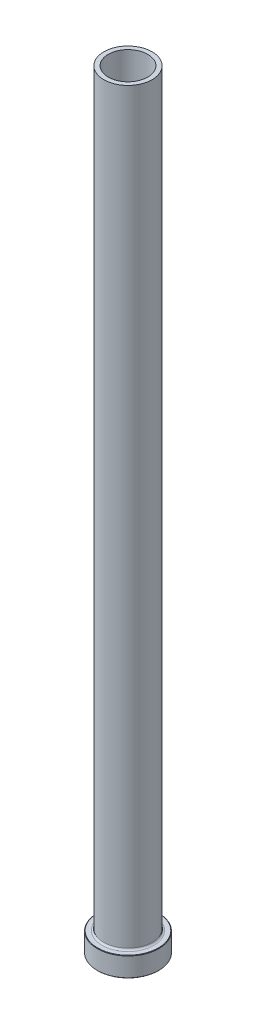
from build123d import *

# Parameters (mm, degrees)
FILLET1_R     = 0.8
CHAMFER1_SIZE = 0.2
CHAMFER3_SIZE = 0.5


with BuildPart() as part:
    # Sketch1 → Revolve1 (revolve)
    with BuildSketch(Plane.XY, mode=Mode.PRIVATE) as revolve1_sk:
        Polygon((-9, 350), (-11, 350), (-11, 9), (-14, 9), (-14, 0), (-9.25, 0), (-9.25, 283), (-9, 295), align=None)
    revolve(revolve1_sk.sketch.rotate(Axis((0, 92.187680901, 0), (0, -1, 0)), 270), axis=Axis((0, 92.187680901, 0), (0, -1, 0)))

    # Fillet1
    fillet1_edges = [part.edges().sort_by_distance(p)[0] for p in [
        (0, 9, -11),
    ]]
    fillet(fillet1_edges, radius=FILLET1_R)

    # Chamfer1
    chamfer1_edges = [part.edges().sort_by_distance(p)[0] for p in [
        (0, 0, -14),
        (0, 9, -14),
    ]]
    chamfer(chamfer1_edges, length=CHAMFER1_SIZE)

    # Chamfer3
    chamfer3_edges = [part.edges().sort_by_distance(p)[0] for p in [
        (0, 0, -9.25),
    ]]
    chamfer(chamfer3_edges, length=CHAMFER3_SIZE)


solid = part.part
